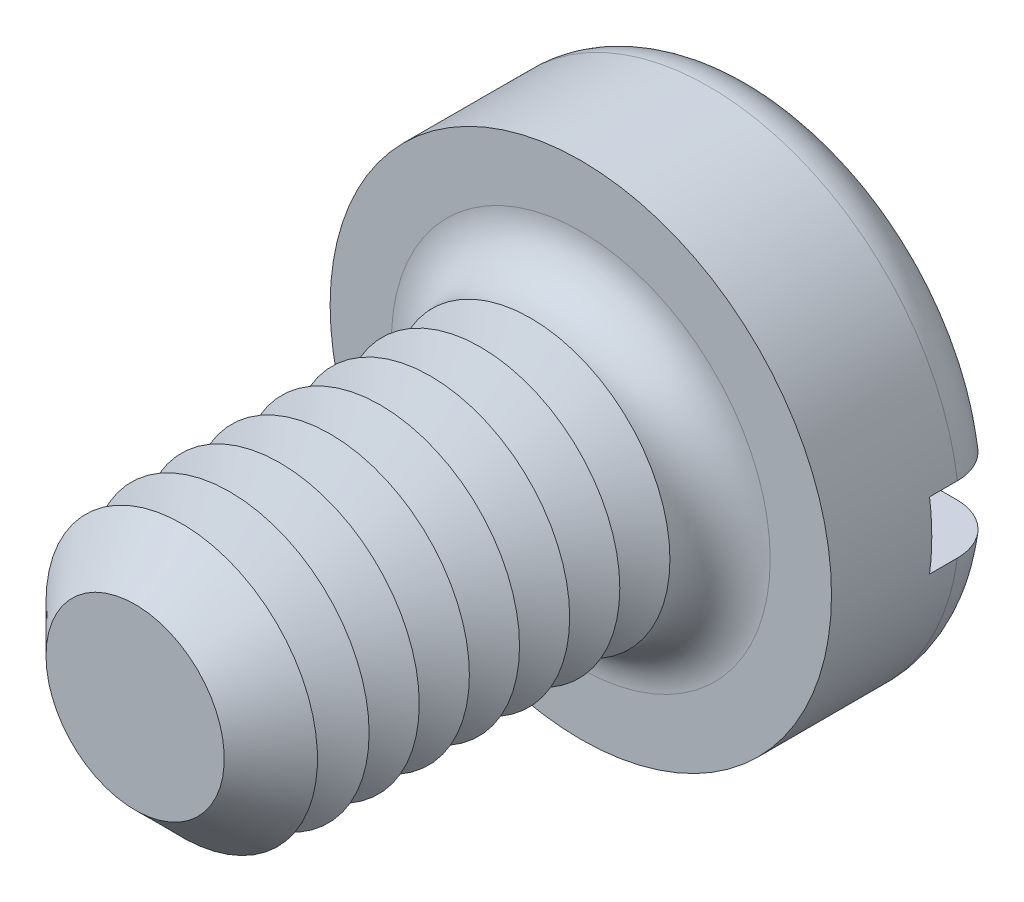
ISO-10303-21;
HEADER;
FILE_DESCRIPTION(('STEP AP214'),'2;1');
FILE_NAME('part.step','',(''),(''),'','','');
FILE_SCHEMA(('AUTOMOTIVE_DESIGN { 1 0 10303 214 1 1 1 1 }'));
ENDSEC;
DATA;
#1=APPLICATION_CONTEXT('core data for automotive mechanical design processes');
#2=APPLICATION_PROTOCOL_DEFINITION('international standard','automotive_design',2000,#1);
#3=PRODUCT_CONTEXT('',#1,'mechanical');
#4=PRODUCT('Part','Part','',(#3));
#5=PRODUCT_RELATED_PRODUCT_CATEGORY('part','',(#4));
#6=PRODUCT_DEFINITION_FORMATION('','',#4);
#7=PRODUCT_DEFINITION_CONTEXT('part definition',#1,'design');
#8=PRODUCT_DEFINITION('design','',#6,#7);
#9=PRODUCT_DEFINITION_SHAPE('','',#8);
#10=(LENGTH_UNIT() NAMED_UNIT(*) SI_UNIT(.MILLI.,.METRE.));
#11=(NAMED_UNIT(*) PLANE_ANGLE_UNIT() SI_UNIT($,.RADIAN.));
#12=(NAMED_UNIT(*) SI_UNIT($,.STERADIAN.) SOLID_ANGLE_UNIT());
#13=UNCERTAINTY_MEASURE_WITH_UNIT(LENGTH_MEASURE(1.E-05),#10,'distance_accuracy_value','');
#14=(GEOMETRIC_REPRESENTATION_CONTEXT(3) GLOBAL_UNCERTAINTY_ASSIGNED_CONTEXT((#13)) GLOBAL_UNIT_ASSIGNED_CONTEXT((#10,
#11,#12)) REPRESENTATION_CONTEXT('',''));
#15=CARTESIAN_POINT('',(0.,0.,0.));
#16=DIRECTION('',(0.,0.,1.));
#17=DIRECTION('',(1.,0.,0.));
#18=AXIS2_PLACEMENT_3D('',#15,#16,#17);
#19=CARTESIAN_POINT('',(0.,0.,-1.6));
#20=DIRECTION('',(0.,0.,1.));
#21=DIRECTION('',(1.,0.,0.));
#22=AXIS2_PLACEMENT_3D('',#19,#20,#21);
#23=PLANE('',#22);
#24=CARTESIAN_POINT('',(0.,0.,-1.6));
#25=DIRECTION('',(0.,0.,1.));
#26=DIRECTION('',(1.,0.,0.));
#27=AXIS2_PLACEMENT_3D('',#24,#25,#26);
#28=CIRCLE('',#27,1.8);
#29=CARTESIAN_POINT('',(-1.77482393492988,0.3,-1.6));
#30=VERTEX_POINT('',#29);
#31=CARTESIAN_POINT('',(1.77482393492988,0.3,-1.6));
#32=VERTEX_POINT('',#31);
#33=EDGE_CURVE('E116',#30,#32,#28,.F.);
#34=ORIENTED_EDGE('',*,*,#33,.T.);
#35=DIRECTION('',(1.,0.,0.));
#36=VECTOR('',#35,1.);
#37=CARTESIAN_POINT('',(-2.25,0.3,-1.6));
#38=LINE('',#37,#36);
#39=EDGE_CURVE('E111',#30,#32,#38,.T.);
#40=ORIENTED_EDGE('',*,*,#39,.F.);
#41=EDGE_LOOP('',(#34,#40));
#42=FACE_BOUND('',#41,.T.);
#43=ADVANCED_FACE('F39',(#42),#23,.F.);
#44=CARTESIAN_POINT('',(0.,0.,-1.15));
#45=DIRECTION('',(0.,0.,1.));
#46=DIRECTION('',(1.,0.,0.));
#47=AXIS2_PLACEMENT_3D('',#44,#45,#46);
#48=TOROIDAL_SURFACE('',#47,1.8,0.45);
#49=CARTESIAN_POINT('',(-2.09367249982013,0.3,-1.4713087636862));
#50=CARTESIAN_POINT('',(-2.07531034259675,0.3,-1.48912990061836));
#51=CARTESIAN_POINT('',(-2.05541605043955,0.3,-1.50540110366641));
#52=CARTESIAN_POINT('',(-2.01315405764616,0.3,-1.53437465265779));
#53=CARTESIAN_POINT('',(-1.99078310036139,0.3,-1.54707221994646));
#54=CARTESIAN_POINT('',(-1.94425163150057,0.3,-1.56853090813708));
#55=CARTESIAN_POINT('',(-1.92009286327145,0.3,-1.57729580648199));
#56=CARTESIAN_POINT('',(-1.8706617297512,0.3,-1.59068015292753));
#57=CARTESIAN_POINT('',(-1.84538964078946,0.3,-1.59530062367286));
#58=CARTESIAN_POINT('',(-1.7942134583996,0.3,-1.60031507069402));
#59=CARTESIAN_POINT('',(-1.76830582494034,0.3,-1.60067291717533));
#60=CARTESIAN_POINT('',(-1.71679040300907,0.3,-1.59707477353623));
#61=CARTESIAN_POINT('',(-1.69118264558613,0.3,-1.59311834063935));
#62=CARTESIAN_POINT('',(-1.64075792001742,0.3,-1.58095464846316));
#63=CARTESIAN_POINT('',(-1.61594989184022,0.3,-1.57271029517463));
#64=CARTESIAN_POINT('',(-1.56806655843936,0.3,-1.55217762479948));
#65=CARTESIAN_POINT('',(-1.54499130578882,0.3,-1.53988918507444));
#66=CARTESIAN_POINT('',(-1.50122413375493,0.3,-1.51158963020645));
#67=CARTESIAN_POINT('',(-1.48053389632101,0.3,-1.49557591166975));
#68=CARTESIAN_POINT('',(-1.44217532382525,0.3,-1.46026359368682));
#69=CARTESIAN_POINT('',(-1.42450683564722,0.3,-1.4409651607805));
#70=CARTESIAN_POINT('',(-1.39293961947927,0.3,-1.39986821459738));
#71=CARTESIAN_POINT('',(-1.37899788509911,0.3,-1.37810275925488));
#72=CARTESIAN_POINT('',(-1.35506190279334,0.3,-1.33249939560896));
#73=CARTESIAN_POINT('',(-1.34506709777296,0.3,-1.30866178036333));
#74=CARTESIAN_POINT('',(-1.3295415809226,0.3,-1.26015137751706));
#75=CARTESIAN_POINT('',(-1.32391771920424,0.3,-1.23550839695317));
#76=CARTESIAN_POINT('',(-1.31696995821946,0.3,-1.18562442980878));
#77=CARTESIAN_POINT('',(-1.31564552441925,0.3,-1.16038351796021));
#78=CARTESIAN_POINT('',(-1.31732714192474,0.3,-1.11049178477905));
#79=CARTESIAN_POINT('',(-1.32025766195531,0.3,-1.08583837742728));
#80=CARTESIAN_POINT('',(-1.3302124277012,0.3,-1.03737369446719));
#81=CARTESIAN_POINT('',(-1.33723664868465,0.3,-1.01356241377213));
#82=CARTESIAN_POINT('',(-1.35515820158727,0.3,-0.967413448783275));
#83=CARTESIAN_POINT('',(-1.36606032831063,0.3,-0.945077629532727));
#84=CARTESIAN_POINT('',(-1.39139351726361,0.3,-0.902507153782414));
#85=CARTESIAN_POINT('',(-1.40582489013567,0.3,-0.882272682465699));
#86=CARTESIAN_POINT('',(-1.43808691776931,0.3,-0.844072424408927));
#87=CARTESIAN_POINT('',(-1.4559757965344,0.3,-0.826155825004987));
#88=CARTESIAN_POINT('',(-1.49445205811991,0.3,-0.793502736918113));
#89=CARTESIAN_POINT('',(-1.51503974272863,0.3,-0.778766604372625));
#90=CARTESIAN_POINT('',(-1.55880475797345,0.3,-0.752571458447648));
#91=CARTESIAN_POINT('',(-1.58202794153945,0.3,-0.741189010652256));
#92=CARTESIAN_POINT('',(-1.63004083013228,0.3,-0.722432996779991));
#93=CARTESIAN_POINT('',(-1.65483064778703,0.3,-0.715059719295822));
#94=CARTESIAN_POINT('',(-1.70558060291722,0.3,-0.704463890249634));
#95=CARTESIAN_POINT('',(-1.73155090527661,0.3,-0.701289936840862));
#96=CARTESIAN_POINT('',(-1.78365633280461,0.3,-0.699350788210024));
#97=CARTESIAN_POINT('',(-1.80979145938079,0.3,-0.700585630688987));
#98=CARTESIAN_POINT('',(-1.86145503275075,0.3,-0.70744393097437));
#99=CARTESIAN_POINT('',(-1.88698403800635,0.3,-0.713063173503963));
#100=CARTESIAN_POINT('',(-1.93672112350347,0.3,-0.728546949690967));
#101=CARTESIAN_POINT('',(-1.96092925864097,0.3,-0.738411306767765));
#102=CARTESIAN_POINT('',(-2.00710191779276,0.3,-0.762015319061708));
#103=CARTESIAN_POINT('',(-2.02908465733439,0.3,-0.775719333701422));
#104=CARTESIAN_POINT('',(-2.0704025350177,0.3,-0.806663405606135));
#105=CARTESIAN_POINT('',(-2.08973782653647,0.3,-0.823903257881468));
#106=CARTESIAN_POINT('',(-2.12497879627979,0.3,-0.861218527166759));
#107=CARTESIAN_POINT('',(-2.1409209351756,0.3,-0.881259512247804));
#108=CARTESIAN_POINT('',(-2.16917502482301,0.3,-0.92375535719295));
#109=CARTESIAN_POINT('',(-2.18148717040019,0.3,-0.946210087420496));
#110=CARTESIAN_POINT('',(-2.20201023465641,0.3,-0.99266079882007));
#111=CARTESIAN_POINT('',(-2.21025973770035,0.3,-1.01663973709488));
#112=CARTESIAN_POINT('',(-2.22258852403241,0.3,-1.06564563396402));
#113=CARTESIAN_POINT('',(-2.22666813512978,0.3,-1.0906725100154));
#114=CARTESIAN_POINT('',(-2.23052418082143,0.3,-1.14090288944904));
#115=CARTESIAN_POINT('',(-2.23032644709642,0.3,-1.16610441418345));
#116=CARTESIAN_POINT('',(-2.22569614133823,0.3,-1.21612212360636));
#117=CARTESIAN_POINT('',(-2.2212625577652,0.3,-1.24093821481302));
#118=CARTESIAN_POINT('',(-2.20829785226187,0.3,-1.2894516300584));
#119=CARTESIAN_POINT('',(-2.19976997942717,0.3,-1.31314982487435));
#120=CARTESIAN_POINT('',(-2.17887390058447,0.3,-1.35876313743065));
#121=CARTESIAN_POINT('',(-2.1665103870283,0.3,-1.3806803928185));
#122=CARTESIAN_POINT('',(-2.14384463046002,0.3,-1.4140108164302));
#123=CARTESIAN_POINT('',(-2.13462949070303,0.3,-1.42617780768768));
#124=CARTESIAN_POINT('',(-2.1150151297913,0.3,-1.44951629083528));
#125=CARTESIAN_POINT('',(-2.10461591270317,0.3,-1.46068778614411));
#126=CARTESIAN_POINT('',(-2.09367249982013,0.3,-1.4713087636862));
#127=B_SPLINE_CURVE_WITH_KNOTS('',3,(#49,#50,#51,#52,#53,#54,#55,#56,#57,#58,#59,#60,#61,#62,
#63,#64,#65,#66,#67,#68,#69,#70,#71,#72,#73,#74,#75,#76,#77,#78,#79,#80,#81,#82,#83,#84,#85,#86,
#87,#88,#89,#90,#91,#92,#93,#94,#95,#96,#97,#98,#99,#100,#101,#102,#103,#104,#105,#106,#107,
#108,#109,#110,#111,#112,#113,#114,#115,#116,#117,#118,#119,#120,#121,#122,#123,#124,#125,#126),
.UNSPECIFIED.,.T.,.F.,(4,2,2,2,2,2,2,2,2,2,2,2,2,2,2,2,2,2,2,2,2,2,2,2,2,2,2,2,2,2,2,2,2,2,2,2,
2,2,4),(0.,0.0767085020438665,0.153519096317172,0.230255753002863,0.306973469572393,
0.384340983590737,0.461716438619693,0.539772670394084,0.617831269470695,0.695944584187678,
0.774053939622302,0.851218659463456,0.928372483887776,1.00383319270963,1.07928451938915,
1.15341274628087,1.22754052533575,1.30176027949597,1.37598656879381,1.45159320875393,
1.52720831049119,1.6044355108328,1.68166826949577,1.75978723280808,1.8379068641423,
1.91595148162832,1.99399285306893,2.07133254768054,2.14866775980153,2.22512456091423,
2.30157725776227,2.3772891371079,2.45299506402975,2.52824391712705,2.60351074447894,
2.67871794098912,2.75383349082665,2.79955010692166,2.84526656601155),.UNSPECIFIED.);
#128=CARTESIAN_POINT('',(-2.22991031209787,0.3,-1.14999999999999));
#129=VERTEX_POINT('',#128);
#130=EDGE_CURVE('E240',#129,#30,#127,.T.);
#131=ORIENTED_EDGE('',*,*,#130,.F.);
#132=CARTESIAN_POINT('',(0.,0.,-1.15));
#133=DIRECTION('',(0.,0.,1.));
#134=DIRECTION('',(1.,0.,0.));
#135=AXIS2_PLACEMENT_3D('',#132,#133,#134);
#136=CIRCLE('',#135,2.25);
#137=CARTESIAN_POINT('',(2.22991031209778,0.3,-1.15));
#138=VERTEX_POINT('',#137);
#139=EDGE_CURVE('E124',#138,#129,#136,.T.);
#140=ORIENTED_EDGE('',*,*,#139,.F.);
#141=CARTESIAN_POINT('',(1.39325818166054,0.3,-1.39903402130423));
#142=CARTESIAN_POINT('',(1.40771723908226,0.3,-1.42030595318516));
#143=CARTESIAN_POINT('',(1.4240122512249,0.3,-1.4403555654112));
#144=CARTESIAN_POINT('',(1.45976320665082,0.3,-1.4774406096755));
#145=CARTESIAN_POINT('',(1.47922380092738,0.3,-1.49447152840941));
#146=CARTESIAN_POINT('',(1.5206923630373,0.3,-1.52502510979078));
#147=CARTESIAN_POINT('',(1.54269721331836,0.3,-1.53855200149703));
#148=CARTESIAN_POINT('',(1.58863815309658,0.3,-1.56176272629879));
#149=CARTESIAN_POINT('',(1.61257369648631,0.3,-1.57144764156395));
#150=CARTESIAN_POINT('',(1.66199169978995,0.3,-1.58680804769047));
#151=CARTESIAN_POINT('',(1.68748839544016,0.3,-1.59243778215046));
#152=CARTESIAN_POINT('',(1.73906656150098,0.3,-1.59934902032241));
#153=CARTESIAN_POINT('',(1.76514807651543,0.3,-1.60063019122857));
#154=CARTESIAN_POINT('',(1.81721740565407,0.3,-1.59879130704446));
#155=CARTESIAN_POINT('',(1.84320486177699,0.3,-1.59566102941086));
#156=CARTESIAN_POINT('',(1.89427635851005,0.3,-1.58504931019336));
#157=CARTESIAN_POINT('',(1.91936042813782,0.3,-1.57756800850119));
#158=CARTESIAN_POINT('',(1.9677137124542,0.3,-1.55851722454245));
#159=CARTESIAN_POINT('',(1.99099484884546,0.3,-1.5469780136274));
#160=CARTESIAN_POINT('',(2.03525897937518,0.3,-1.52011224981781));
#161=CARTESIAN_POINT('',(2.05624211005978,0.3,-1.50478592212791));
#162=CARTESIAN_POINT('',(2.09506403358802,0.3,-1.47096472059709));
#163=CARTESIAN_POINT('',(2.11293536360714,0.3,-1.45250719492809));
#164=CARTESIAN_POINT('',(2.14528563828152,0.3,-1.41282609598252));
#165=CARTESIAN_POINT('',(2.15976477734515,0.3,-1.39160268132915));
#166=CARTESIAN_POINT('',(2.18476262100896,0.3,-1.34723254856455));
#167=CARTESIAN_POINT('',(2.19532119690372,0.3,-1.32410828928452));
#168=CARTESIAN_POINT('',(2.21237438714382,0.3,-1.27640693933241));
#169=CARTESIAN_POINT('',(2.21886918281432,0.3,-1.25182991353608));
#170=CARTESIAN_POINT('',(2.2275687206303,0.3,-1.20210937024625));
#171=CARTESIAN_POINT('',(2.22980376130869,0.3,-1.17697115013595));
#172=CARTESIAN_POINT('',(2.23000940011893,0.3,-1.12667754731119));
#173=CARTESIAN_POINT('',(2.22798009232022,0.3,-1.10152216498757));
#174=CARTESIAN_POINT('',(2.21972856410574,0.3,-1.05197773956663));
#175=CARTESIAN_POINT('',(2.21351744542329,0.3,-1.02758684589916));
#176=CARTESIAN_POINT('',(2.19709696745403,0.3,-0.980190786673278));
#177=CARTESIAN_POINT('',(2.18688760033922,0.3,-0.957185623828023));
#178=CARTESIAN_POINT('',(2.1627435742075,0.3,-0.913157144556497));
#179=CARTESIAN_POINT('',(2.14880093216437,0.3,-0.892138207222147));
#180=CARTESIAN_POINT('',(2.11760640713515,0.3,-0.852719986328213));
#181=CARTESIAN_POINT('',(2.10035443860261,0.3,-0.834320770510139));
#182=CARTESIAN_POINT('',(2.06291254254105,0.3,-0.80052923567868));
#183=CARTESIAN_POINT('',(2.04270386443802,0.3,-0.785157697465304));
#184=CARTESIAN_POINT('',(2.0000139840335,0.3,-0.757986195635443));
#185=CARTESIAN_POINT('',(1.97753267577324,0.3,-0.746186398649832));
#186=CARTESIAN_POINT('',(1.93069507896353,0.3,-0.726364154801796));
#187=CARTESIAN_POINT('',(1.90632219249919,0.3,-0.718380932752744));
#188=CARTESIAN_POINT('',(1.85658993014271,0.3,-0.706569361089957));
#189=CARTESIAN_POINT('',(1.83123049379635,0.3,-0.702741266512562));
#190=CARTESIAN_POINT('',(1.77994107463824,0.3,-0.699306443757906));
#191=CARTESIAN_POINT('',(1.75400788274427,0.3,-0.69974759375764));
#192=CARTESIAN_POINT('',(1.70257608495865,0.3,-0.704939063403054));
#193=CARTESIAN_POINT('',(1.67707750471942,0.3,-0.709689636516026));
#194=CARTESIAN_POINT('',(1.62701662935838,0.3,-0.723419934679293));
#195=CARTESIAN_POINT('',(1.60246387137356,0.3,-0.732434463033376));
#196=CARTESIAN_POINT('',(1.55521886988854,0.3,-0.754458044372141));
#197=CARTESIAN_POINT('',(1.53252668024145,0.3,-0.76746721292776));
#198=CARTESIAN_POINT('',(1.48966925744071,0.3,-0.797124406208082));
#199=CARTESIAN_POINT('',(1.46950315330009,0.3,-0.813771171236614));
#200=CARTESIAN_POINT('',(1.43229728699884,0.3,-0.850255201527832));
#201=CARTESIAN_POINT('',(1.41525734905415,0.3,-0.870092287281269));
#202=CARTESIAN_POINT('',(1.3850470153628,0.3,-0.912123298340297));
#203=CARTESIAN_POINT('',(1.37182821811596,0.3,-0.934282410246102));
#204=CARTESIAN_POINT('',(1.34939737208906,0.3,-0.980542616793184));
#205=CARTESIAN_POINT('',(1.34018456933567,0.3,-1.00464334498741));
#206=CARTESIAN_POINT('',(1.32624172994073,0.3,-1.05352472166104));
#207=CARTESIAN_POINT('',(1.32141599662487,0.3,-1.07827808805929));
#208=CARTESIAN_POINT('',(1.31606478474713,0.3,-1.12825155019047));
#209=CARTESIAN_POINT('',(1.31553992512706,0.3,-1.15347171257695));
#210=CARTESIAN_POINT('',(1.31878307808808,0.3,-1.20323022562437));
#211=CARTESIAN_POINT('',(1.32248353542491,0.3,-1.22777305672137));
#212=CARTESIAN_POINT('',(1.33394086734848,0.3,-1.27586981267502));
#213=CARTESIAN_POINT('',(1.34169274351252,0.3,-1.2994249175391));
#214=CARTESIAN_POINT('',(1.35704250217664,0.3,-1.33561898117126));
#215=CARTESIAN_POINT('',(1.36341395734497,0.3,-1.34879219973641));
#216=CARTESIAN_POINT('',(1.37741190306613,0.3,-1.37445328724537));
#217=CARTESIAN_POINT('',(1.38503837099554,0.3,-1.38694116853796));
#218=CARTESIAN_POINT('',(1.39325818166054,0.3,-1.39903402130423));
#219=B_SPLINE_CURVE_WITH_KNOTS('',3,(#141,#142,#143,#144,#145,#146,#147,#148,#149,#150,#151,
#152,#153,#154,#155,#156,#157,#158,#159,#160,#161,#162,#163,#164,#165,#166,#167,#168,#169,#170,
#171,#172,#173,#174,#175,#176,#177,#178,#179,#180,#181,#182,#183,#184,#185,#186,#187,#188,#189,
#190,#191,#192,#193,#194,#195,#196,#197,#198,#199,#200,#201,#202,#203,#204,#205,#206,#207,#208,
#209,#210,#211,#212,#213,#214,#215,#216,#217,#218),.UNSPECIFIED.,.T.,.F.,(4,2,2,2,2,2,2,2,2,2,2,
2,2,2,2,2,2,2,2,2,2,2,2,2,2,2,2,2,2,2,2,2,2,2,2,2,2,2,4),(0.,0.0771077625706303,
0.154329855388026,0.231458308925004,0.308565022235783,0.386528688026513,0.464498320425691,
0.542648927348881,0.620797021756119,0.698374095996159,0.77594655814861,0.852651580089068,
0.929352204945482,1.00524992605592,1.08114426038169,1.15649673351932,1.2318475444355,
1.30699910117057,1.38215080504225,1.45746451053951,1.53278016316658,1.60859599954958,
1.68441537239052,1.76099806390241,1.83758545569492,1.91503273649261,1.99248457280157,
2.07057979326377,2.14867727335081,2.22674775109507,2.30481383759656,2.38184276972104,
2.45885719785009,2.53414829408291,2.6094502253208,2.68356487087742,2.75758829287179,
2.80142397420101,2.84525886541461),.UNSPECIFIED.);
#220=EDGE_CURVE('E242',#32,#138,#219,.T.);
#221=ORIENTED_EDGE('',*,*,#220,.F.);
#222=ORIENTED_EDGE('',*,*,#33,.F.);
#223=EDGE_LOOP('',(#131,#140,#221,#222));
#224=FACE_BOUND('',#223,.T.);
#225=ADVANCED_FACE('F224',(#224),#48,.T.);
#226=CARTESIAN_POINT('',(0.,0.,-1.6));
#227=DIRECTION('',(0.,0.,1.));
#228=DIRECTION('',(1.,0.,0.));
#229=AXIS2_PLACEMENT_3D('',#226,#227,#228);
#230=CYLINDRICAL_SURFACE('',#229,2.25);
#231=DIRECTION('',(0.,0.,1.));
#232=VECTOR('',#231,1.);
#233=CARTESIAN_POINT('',(2.22991031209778,0.3,-1.6));
#234=LINE('',#233,#232);
#235=CARTESIAN_POINT('',(2.22991031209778,0.3,-0.9));
#236=VERTEX_POINT('',#235);
#237=EDGE_CURVE('E256',#138,#236,#234,.T.);
#238=ORIENTED_EDGE('',*,*,#237,.F.);
#239=ORIENTED_EDGE('',*,*,#139,.T.);
#240=DIRECTION('',(0.,0.,1.));
#241=VECTOR('',#240,1.);
#242=CARTESIAN_POINT('',(-2.22991031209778,0.3,-1.6));
#243=LINE('',#242,#241);
#244=CARTESIAN_POINT('',(-2.22991031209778,0.3,-0.9));
#245=VERTEX_POINT('',#244);
#246=EDGE_CURVE('E63',#245,#129,#243,.F.);
#247=ORIENTED_EDGE('',*,*,#246,.F.);
#248=CARTESIAN_POINT('',(0.,0.,-0.9));
#249=DIRECTION('',(0.,0.,-1.));
#250=DIRECTION('',(-1.,0.,0.));
#251=AXIS2_PLACEMENT_3D('',#248,#249,#250);
#252=CIRCLE('',#251,2.25);
#253=CARTESIAN_POINT('',(-2.22991031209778,-0.3,-0.9));
#254=VERTEX_POINT('',#253);
#255=EDGE_CURVE('E43',#245,#254,#252,.F.);
#256=ORIENTED_EDGE('',*,*,#255,.T.);
#257=DIRECTION('',(0.,0.,1.));
#258=VECTOR('',#257,1.);
#259=CARTESIAN_POINT('',(-2.22991031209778,-0.3,-1.6));
#260=LINE('',#259,#258);
#261=CARTESIAN_POINT('',(-2.22991031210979,-0.3,-1.15000000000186));
#262=VERTEX_POINT('',#261);
#263=EDGE_CURVE('E254',#262,#254,#260,.T.);
#264=ORIENTED_EDGE('',*,*,#263,.F.);
#265=CARTESIAN_POINT('',(2.22991031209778,-0.3,-1.15));
#266=VERTEX_POINT('',#265);
#267=EDGE_CURVE('E126',#262,#266,#136,.T.);
#268=ORIENTED_EDGE('',*,*,#267,.T.);
#269=DIRECTION('',(0.,0.,1.));
#270=VECTOR('',#269,1.);
#271=CARTESIAN_POINT('',(2.22991031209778,-0.3,-1.6));
#272=LINE('',#271,#270);
#273=CARTESIAN_POINT('',(2.22991031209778,-0.3,-0.9));
#274=VERTEX_POINT('',#273);
#275=EDGE_CURVE('E55',#274,#266,#272,.F.);
#276=ORIENTED_EDGE('',*,*,#275,.F.);
#277=EDGE_CURVE('E11',#274,#236,#252,.F.);
#278=ORIENTED_EDGE('',*,*,#277,.T.);
#279=EDGE_LOOP('',(#238,#239,#247,#256,#264,#268,#276,#278));
#280=FACE_BOUND('',#279,.T.);
#281=CARTESIAN_POINT('',(0.,0.,0.));
#282=DIRECTION('',(0.,0.,1.));
#283=DIRECTION('',(1.,0.,0.));
#284=AXIS2_PLACEMENT_3D('',#281,#282,#283);
#285=CIRCLE('',#284,2.25);
#286=CARTESIAN_POINT('',(2.25,0.,0.));
#287=VERTEX_POINT('',#286);
#288=EDGE_CURVE('E259',#287,#287,#285,.T.);
#289=ORIENTED_EDGE('',*,*,#288,.F.);
#290=EDGE_LOOP('',(#289));
#291=FACE_BOUND('',#290,.T.);
#292=ADVANCED_FACE('F220',(#280,#291),#230,.T.);
#293=CARTESIAN_POINT('',(1.77482393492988,-0.3,-1.6));
#294=VERTEX_POINT('',#293);
#295=CARTESIAN_POINT('',(-1.77482393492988,-0.3,-1.6));
#296=VERTEX_POINT('',#295);
#297=EDGE_CURVE('E109',#294,#296,#28,.F.);
#298=ORIENTED_EDGE('',*,*,#297,.T.);
#299=DIRECTION('',(-1.,0.,0.));
#300=VECTOR('',#299,1.);
#301=CARTESIAN_POINT('',(-2.25,-0.3,-1.6));
#302=LINE('',#301,#300);
#303=EDGE_CURVE('E96',#294,#296,#302,.T.);
#304=ORIENTED_EDGE('',*,*,#303,.F.);
#305=EDGE_LOOP('',(#298,#304));
#306=FACE_BOUND('',#305,.T.);
#307=ADVANCED_FACE('F108',(#306),#23,.F.);
#308=CARTESIAN_POINT('',(0.,0.,0.));
#309=DIRECTION('',(0.,0.,1.));
#310=DIRECTION('',(1.,0.,0.));
#311=AXIS2_PLACEMENT_3D('',#308,#309,#310);
#312=PLANE('',#311);
#313=CARTESIAN_POINT('',(0.,0.,0.));
#314=DIRECTION('',(0.,0.,1.));
#315=DIRECTION('',(1.,0.,0.));
#316=AXIS2_PLACEMENT_3D('',#313,#314,#315);
#317=CIRCLE('',#316,1.7);
#318=CARTESIAN_POINT('',(1.7,0.,0.));
#319=VERTEX_POINT('',#318);
#320=EDGE_CURVE('E115',#319,#319,#317,.F.);
#321=ORIENTED_EDGE('',*,*,#320,.T.);
#322=EDGE_LOOP('',(#321));
#323=FACE_BOUND('',#322,.T.);
#324=ORIENTED_EDGE('',*,*,#288,.T.);
#325=EDGE_LOOP('',(#324));
#326=FACE_BOUND('',#325,.T.);
#327=ADVANCED_FACE('F219',(#323,#326),#312,.T.);
#328=CARTESIAN_POINT('',(-2.09367249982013,-0.3,-1.4713087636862));
#329=CARTESIAN_POINT('',(-2.11176539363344,-0.3,-1.45374579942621));
#330=CARTESIAN_POINT('',(-2.1283968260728,-0.3,-1.43465254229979));
#331=CARTESIAN_POINT('',(-2.15823692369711,-0.3,-1.39393307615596));
#332=CARTESIAN_POINT('',(-2.17144184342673,-0.3,-1.37230413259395));
#333=CARTESIAN_POINT('',(-2.19402281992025,-0.3,-1.32713362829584));
#334=CARTESIAN_POINT('',(-2.20339951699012,-0.3,-1.30359238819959));
#335=CARTESIAN_POINT('',(-2.21804409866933,-0.3,-1.25527081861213));
#336=CARTESIAN_POINT('',(-2.22331295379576,-0.3,-1.23049078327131));
#337=CARTESIAN_POINT('',(-2.22957448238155,-0.3,-1.18050893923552));
#338=CARTESIAN_POINT('',(-2.23058617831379,-0.3,-1.15530951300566));
#339=CARTESIAN_POINT('',(-2.22835535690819,-0.3,-1.10509920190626));
#340=CARTESIAN_POINT('',(-2.22511277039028,-0.3,-1.08008832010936));
#341=CARTESIAN_POINT('',(-2.21448018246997,-0.3,-1.03101646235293));
#342=CARTESIAN_POINT('',(-2.20709836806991,-0.3,-1.00695371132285));
#343=CARTESIAN_POINT('',(-2.18841075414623,-0.3,-0.960404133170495));
#344=CARTESIAN_POINT('',(-2.17710493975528,-0.3,-0.937917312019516));
#345=CARTESIAN_POINT('',(-2.15086234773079,-0.3,-0.895085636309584));
#346=CARTESIAN_POINT('',(-2.13591537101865,-0.3,-0.874747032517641));
#347=CARTESIAN_POINT('',(-2.1028415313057,-0.3,-0.836845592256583));
#348=CARTESIAN_POINT('',(-2.08471458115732,-0.3,-0.819282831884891));
#349=CARTESIAN_POINT('',(-2.0456590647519,-0.3,-0.78729174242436));
#350=CARTESIAN_POINT('',(-2.0247112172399,-0.3,-0.772886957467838));
#351=CARTESIAN_POINT('',(-1.98071452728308,-0.3,-0.747756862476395));
#352=CARTESIAN_POINT('',(-1.95766557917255,-0.3,-0.737031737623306));
#353=CARTESIAN_POINT('',(-1.90986554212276,-0.3,-0.71944451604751));
#354=CARTESIAN_POINT('',(-1.88509923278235,-0.3,-0.712623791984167));
#355=CARTESIAN_POINT('',(-1.83477837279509,-0.3,-0.703186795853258));
#356=CARTESIAN_POINT('',(-1.80922377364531,-0.3,-0.700570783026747));
#357=CARTESIAN_POINT('',(-1.75774893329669,-0.3,-0.699591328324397));
#358=CARTESIAN_POINT('',(-1.73182778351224,-0.3,-0.701275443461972));
#359=CARTESIAN_POINT('',(-1.68062744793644,-0.3,-0.708937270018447));
#360=CARTESIAN_POINT('',(-1.65534829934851,-0.3,-0.714915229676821));
#361=CARTESIAN_POINT('',(-1.6059539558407,-0.3,-0.731056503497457));
#362=CARTESIAN_POINT('',(-1.58184881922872,-0.3,-0.741250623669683));
#363=CARTESIAN_POINT('',(-1.53569497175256,-0.3,-0.765548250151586));
#364=CARTESIAN_POINT('',(-1.51364629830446,-0.3,-0.779651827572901));
#365=CARTESIAN_POINT('',(-1.47229470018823,-0.3,-0.811355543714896));
#366=CARTESIAN_POINT('',(-1.45298625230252,-0.3,-0.828948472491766));
#367=CARTESIAN_POINT('',(-1.41765142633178,-0.3,-0.867170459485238));
#368=CARTESIAN_POINT('',(-1.40162480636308,-0.3,-0.887799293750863));
#369=CARTESIAN_POINT('',(-1.37358365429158,-0.3,-0.93118317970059));
#370=CARTESIAN_POINT('',(-1.3615121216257,-0.3,-0.953901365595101));
#371=CARTESIAN_POINT('',(-1.34145576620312,-0.3,-1.00107529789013));
#372=CARTESIAN_POINT('',(-1.33347032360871,-0.3,-1.02553078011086));
#373=CARTESIAN_POINT('',(-1.32199536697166,-0.3,-1.07489401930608));
#374=CARTESIAN_POINT('',(-1.31840873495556,-0.3,-1.09977921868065));
#375=CARTESIAN_POINT('',(-1.31553052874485,-0.3,-1.1497957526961));
#376=CARTESIAN_POINT('',(-1.31623852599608,-0.3,-1.17492706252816));
#377=CARTESIAN_POINT('',(-1.32188368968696,-0.3,-1.22435119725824));
#378=CARTESIAN_POINT('',(-1.32676151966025,-0.3,-1.24865083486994));
#379=CARTESIAN_POINT('',(-1.34050334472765,-0.3,-1.29609421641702));
#380=CARTESIAN_POINT('',(-1.34936742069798,-0.3,-1.31923793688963));
#381=CARTESIAN_POINT('',(-1.37086295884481,-0.3,-1.36387796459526));
#382=CARTESIAN_POINT('',(-1.38351729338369,-0.3,-1.38536324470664));
#383=CARTESIAN_POINT('',(-1.41218367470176,-0.3,-1.42596199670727));
#384=CARTESIAN_POINT('',(-1.42819606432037,-0.3,-1.44507522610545));
#385=CARTESIAN_POINT('',(-1.46347664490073,-0.3,-1.48081087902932));
#386=CARTESIAN_POINT('',(-1.48280543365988,-0.3,-1.49737347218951));
#387=CARTESIAN_POINT('',(-1.5239232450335,-0.3,-1.52709508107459));
#388=CARTESIAN_POINT('',(-1.54571253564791,-0.3,-1.54025372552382));
#389=CARTESIAN_POINT('',(-1.59160097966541,-0.3,-1.56305446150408));
#390=CARTESIAN_POINT('',(-1.61573734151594,-0.3,-1.57262172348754));
#391=CARTESIAN_POINT('',(-1.66526504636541,-0.3,-1.58760700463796));
#392=CARTESIAN_POINT('',(-1.69065641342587,-0.3,-1.59302494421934));
#393=CARTESIAN_POINT('',(-1.74220154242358,-0.3,-1.59958446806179));
#394=CARTESIAN_POINT('',(-1.7683598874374,-0.3,-1.60069012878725));
#395=CARTESIAN_POINT('',(-1.82049681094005,-0.3,-1.59847888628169));
#396=CARTESIAN_POINT('',(-1.8464753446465,-0.3,-1.59516091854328));
#397=CARTESIAN_POINT('',(-1.89742078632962,-0.3,-1.58419269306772));
#398=CARTESIAN_POINT('',(-1.92239041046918,-0.3,-1.57655503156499));
#399=CARTESIAN_POINT('',(-1.97064988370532,-0.3,-1.55715679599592));
#400=CARTESIAN_POINT('',(-1.99394179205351,-0.3,-1.54540138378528));
#401=CARTESIAN_POINT('',(-2.03003215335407,-0.3,-1.52312594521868));
#402=CARTESIAN_POINT('',(-2.04354254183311,-0.3,-1.51373809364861));
#403=CARTESIAN_POINT('',(-2.06946640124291,-0.3,-1.49355310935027));
#404=CARTESIAN_POINT('',(-2.08187987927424,-0.3,-1.48275598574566));
#405=CARTESIAN_POINT('',(-2.09367249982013,-0.3,-1.4713087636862));
#406=B_SPLINE_CURVE_WITH_KNOTS('',3,(#328,#329,#330,#331,#332,#333,#334,#335,#336,#337,#338,
#339,#340,#341,#342,#343,#344,#345,#346,#347,#348,#349,#350,#351,#352,#353,#354,#355,#356,#357,
#358,#359,#360,#361,#362,#363,#364,#365,#366,#367,#368,#369,#370,#371,#372,#373,#374,#375,#376,
#377,#378,#379,#380,#381,#382,#383,#384,#385,#386,#387,#388,#389,#390,#391,#392,#393,#394,#395,
#396,#397,#398,#399,#400,#401,#402,#403,#404,#405),.UNSPECIFIED.,.T.,.F.,(4,2,2,2,2,2,2,2,2,2,2,
2,2,2,2,2,2,2,2,2,2,2,2,2,2,2,2,2,2,2,2,2,2,2,2,2,2,2,4),(0.,0.0755864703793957,
0.151255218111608,0.226911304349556,0.302549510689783,0.377849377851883,0.453150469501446,
0.528303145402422,0.603456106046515,0.67882204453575,0.754190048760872,0.83010216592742,
0.906018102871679,0.982724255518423,1.05943513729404,1.13699806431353,1.21456547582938,
1.29270994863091,1.37085584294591,1.44884191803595,1.52682224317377,1.60362346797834,
1.68041303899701,1.75547480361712,1.83052907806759,1.90453278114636,1.97853798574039,
2.05299909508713,2.12746781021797,2.20347986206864,2.27950020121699,2.3570265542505,
2.43455439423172,2.5127267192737,2.59091785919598,2.66888216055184,2.74674907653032,
2.79601528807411,2.84528118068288),.UNSPECIFIED.);
#407=EDGE_CURVE('E103',#296,#262,#406,.T.);
#408=ORIENTED_EDGE('',*,*,#407,.F.);
#409=ORIENTED_EDGE('',*,*,#297,.F.);
#410=CARTESIAN_POINT('',(1.39325818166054,-0.3,-1.39903402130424));
#411=CARTESIAN_POINT('',(1.37924349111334,-0.3,-1.37841200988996));
#412=CARTESIAN_POINT('',(1.36693374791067,-0.3,-1.35661225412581));
#413=CARTESIAN_POINT('',(1.34612289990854,-0.3,-1.31124547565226));
#414=CARTESIAN_POINT('',(1.33762533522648,-0.3,-1.28767683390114));
#415=CARTESIAN_POINT('',(1.32472877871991,-0.3,-1.23943261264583));
#416=CARTESIAN_POINT('',(1.3203309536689,-0.3,-1.21475672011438));
#417=CARTESIAN_POINT('',(1.31579198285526,-0.3,-1.16502199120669));
#418=CARTESIAN_POINT('',(1.31564980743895,-0.3,-1.13996324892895));
#419=CARTESIAN_POINT('',(1.31960322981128,-0.3,-1.09044336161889));
#420=CARTESIAN_POINT('',(1.32365524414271,-0.3,-1.06597872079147));
#421=CARTESIAN_POINT('',(1.33579339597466,-0.3,-1.01807218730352));
#422=CARTESIAN_POINT('',(1.34387971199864,-0.3,-0.994630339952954));
#423=CARTESIAN_POINT('',(1.36386460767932,-0.3,-0.949319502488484));
#424=CARTESIAN_POINT('',(1.37577869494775,-0.3,-0.92745736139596));
#425=CARTESIAN_POINT('',(1.40303929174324,-0.3,-0.885990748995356));
#426=CARTESIAN_POINT('',(1.41838612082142,-0.3,-0.866386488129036));
#427=CARTESIAN_POINT('',(1.45239955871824,-0.3,-0.829572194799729));
#428=CARTESIAN_POINT('',(1.47112624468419,-0.3,-0.812417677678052));
#429=CARTESIAN_POINT('',(1.51114353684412,-0.3,-0.78141873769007));
#430=CARTESIAN_POINT('',(1.53243442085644,-0.3,-0.767574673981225));
#431=CARTESIAN_POINT('',(1.57744959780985,-0.3,-0.743302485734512));
#432=CARTESIAN_POINT('',(1.6012148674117,-0.3,-0.732950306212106));
#433=CARTESIAN_POINT('',(1.65013556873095,-0.3,-0.71633816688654));
#434=CARTESIAN_POINT('',(1.67529109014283,-0.3,-0.710078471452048));
#435=CARTESIAN_POINT('',(1.72654223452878,-0.3,-0.701786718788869));
#436=CARTESIAN_POINT('',(1.75264462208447,-0.3,-0.699796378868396));
#437=CARTESIAN_POINT('',(1.80481283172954,-0.3,-0.700236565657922));
#438=CARTESIAN_POINT('',(1.83087865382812,-0.3,-0.702667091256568));
#439=CARTESIAN_POINT('',(1.88216421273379,-0.3,-0.71188843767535));
#440=CARTESIAN_POINT('',(1.90738581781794,-0.3,-0.718668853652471));
#441=CARTESIAN_POINT('',(1.95631449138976,-0.3,-0.736408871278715));
#442=CARTESIAN_POINT('',(1.98002162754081,-0.3,-0.747368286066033));
#443=CARTESIAN_POINT('',(2.02500221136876,-0.3,-0.773046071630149));
#444=CARTESIAN_POINT('',(2.04629687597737,-0.3,-0.78772726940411));
#445=CARTESIAN_POINT('',(2.08608258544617,-0.3,-0.820494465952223));
#446=CARTESIAN_POINT('',(2.10457379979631,-0.3,-0.838580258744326));
#447=CARTESIAN_POINT('',(2.1380062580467,-0.3,-0.877422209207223));
#448=CARTESIAN_POINT('',(2.15298532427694,-0.3,-0.898145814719));
#449=CARTESIAN_POINT('',(2.17921311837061,-0.3,-0.941832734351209));
#450=CARTESIAN_POINT('',(2.19046204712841,-0.3,-0.964795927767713));
#451=CARTESIAN_POINT('',(2.20880507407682,-0.3,-1.01207981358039));
#452=CARTESIAN_POINT('',(2.2159367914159,-0.3,-1.0363859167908));
#453=CARTESIAN_POINT('',(2.22599386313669,-0.3,-1.08585317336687));
#454=CARTESIAN_POINT('',(2.22891936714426,-0.3,-1.11101429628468));
#455=CARTESIAN_POINT('',(2.23047255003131,-0.3,-1.16133395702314));
#456=CARTESIAN_POINT('',(2.22912306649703,-0.3,-1.18649179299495));
#457=CARTESIAN_POINT('',(2.22221641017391,-0.3,-1.236222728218));
#458=CARTESIAN_POINT('',(2.21665928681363,-0.3,-1.26079583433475));
#459=CARTESIAN_POINT('',(2.20150655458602,-0.3,-1.30864604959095));
#460=CARTESIAN_POINT('',(2.19191347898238,-0.3,-1.3319239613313));
#461=CARTESIAN_POINT('',(2.16897085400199,-0.3,-1.37654778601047));
#462=CARTESIAN_POINT('',(2.15562126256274,-0.3,-1.39789367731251));
#463=CARTESIAN_POINT('',(2.12549147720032,-0.3,-1.43814583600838));
#464=CARTESIAN_POINT('',(2.1086973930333,-0.3,-1.45704170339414));
#465=CARTESIAN_POINT('',(2.07219852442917,-0.3,-1.491773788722));
#466=CARTESIAN_POINT('',(2.0524936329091,-0.3,-1.50760989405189));
#467=CARTESIAN_POINT('',(2.01056127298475,-0.3,-1.53591667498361));
#468=CARTESIAN_POINT('',(1.98831430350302,-0.3,-1.54835845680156));
#469=CARTESIAN_POINT('',(1.94206418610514,-0.3,-1.5693763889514));
#470=CARTESIAN_POINT('',(1.91806093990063,-0.3,-1.57795232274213));
#471=CARTESIAN_POINT('',(1.86869953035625,-0.3,-1.5910955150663));
#472=CARTESIAN_POINT('',(1.84332941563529,-0.3,-1.59561788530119));
#473=CARTESIAN_POINT('',(1.7921914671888,-0.3,-1.60038767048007));
#474=CARTESIAN_POINT('',(1.76642362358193,-0.3,-1.60063497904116));
#475=CARTESIAN_POINT('',(1.71493241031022,-0.3,-1.59684388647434));
#476=CARTESIAN_POINT('',(1.6892123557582,-0.3,-1.59276040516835));
#477=CARTESIAN_POINT('',(1.63880694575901,-0.3,-1.58035661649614));
#478=CARTESIAN_POINT('',(1.61412189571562,-0.3,-1.5720350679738));
#479=CARTESIAN_POINT('',(1.56635013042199,-0.3,-1.55132424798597));
#480=CARTESIAN_POINT('',(1.54327365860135,-0.3,-1.53891136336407));
#481=CARTESIAN_POINT('',(1.49956705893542,-0.3,-1.51037484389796));
#482=CARTESIAN_POINT('',(1.478934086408,-0.3,-1.49425558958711));
#483=CARTESIAN_POINT('',(1.44732882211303,-0.3,-1.46489751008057));
#484=CARTESIAN_POINT('',(1.43548118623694,-0.3,-1.45258668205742));
#485=CARTESIAN_POINT('',(1.41324217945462,-0.3,-1.42671249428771));
#486=CARTESIAN_POINT('',(1.40285079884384,-0.3,-1.41314914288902));
#487=CARTESIAN_POINT('',(1.39325818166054,-0.3,-1.39903402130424));
#488=B_SPLINE_CURVE_WITH_KNOTS('',3,(#410,#411,#412,#413,#414,#415,#416,#417,#418,#419,#420,
#421,#422,#423,#424,#425,#426,#427,#428,#429,#430,#431,#432,#433,#434,#435,#436,#437,#438,#439,
#440,#441,#442,#443,#444,#445,#446,#447,#448,#449,#450,#451,#452,#453,#454,#455,#456,#457,#458,
#459,#460,#461,#462,#463,#464,#465,#466,#467,#468,#469,#470,#471,#472,#473,#474,#475,#476,#477,
#478,#479,#480,#481,#482,#483,#484,#485,#486,#487),.UNSPECIFIED.,.T.,.F.,(4,2,2,2,2,2,2,2,2,2,2,
2,2,2,2,2,2,2,2,2,2,2,2,2,2,2,2,2,2,2,2,2,2,2,2,2,2,2,4),(0.,0.0747398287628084,
0.149548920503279,0.224379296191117,0.29919156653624,0.373234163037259,0.447280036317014,
0.521629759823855,0.595986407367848,0.671825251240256,0.747672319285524,0.825076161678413,
0.902485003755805,0.980646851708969,1.05880868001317,1.13678424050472,1.21475631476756,
1.29197834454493,1.36919570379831,1.44553881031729,1.52187780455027,1.59750777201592,
1.67313504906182,1.74835899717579,1.82358206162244,1.89875798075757,1.97393474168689,
2.04942084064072,2.12490971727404,2.20102244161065,2.27713942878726,2.35408926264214,
2.43104101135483,2.50880170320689,2.58658518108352,2.66482568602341,2.74297419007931,
2.79413160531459,2.84528867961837),.UNSPECIFIED.);
#489=EDGE_CURVE('E92',#266,#294,#488,.T.);
#490=ORIENTED_EDGE('',*,*,#489,.F.);
#491=ORIENTED_EDGE('',*,*,#267,.F.);
#492=EDGE_LOOP('',(#408,#409,#490,#491));
#493=FACE_BOUND('',#492,.T.);
#494=ADVANCED_FACE('F113',(#493),#48,.T.);
#495=CARTESIAN_POINT('',(0.,0.,0.45));
#496=DIRECTION('',(0.,0.,1.));
#497=DIRECTION('',(1.,0.,0.));
#498=AXIS2_PLACEMENT_3D('',#495,#496,#497);
#499=TOROIDAL_SURFACE('',#498,1.7,0.45);
#500=ORIENTED_EDGE('',*,*,#320,.F.);
#501=EDGE_LOOP('',(#500));
#502=FACE_BOUND('',#501,.T.);
#503=CARTESIAN_POINT('',(0.,0.,0.45));
#504=DIRECTION('',(0.,0.,-1.));
#505=DIRECTION('',(-1.,0.,0.));
#506=AXIS2_PLACEMENT_3D('',#503,#504,#505);
#507=CIRCLE('',#506,1.25);
#508=CARTESIAN_POINT('',(-1.25,0.,0.45));
#509=VERTEX_POINT('',#508);
#510=EDGE_CURVE('E264',#509,#509,#507,.T.);
#511=ORIENTED_EDGE('',*,*,#510,.T.);
#512=EDGE_LOOP('',(#511));
#513=FACE_BOUND('',#512,.T.);
#514=ADVANCED_FACE('F212',(#502,#513),#499,.F.);
#515=CARTESIAN_POINT('',(0.,0.,0.675));
#516=DIRECTION('',(0.,0.,-1.));
#517=DIRECTION('',(-1.,0.,0.));
#518=AXIS2_PLACEMENT_3D('',#515,#516,#517);
#519=CONICAL_SURFACE('',#518,0.860288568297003,1.0471975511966);
#520=ORIENTED_EDGE('',*,*,#510,.F.);
#521=EDGE_LOOP('',(#520));
#522=FACE_BOUND('',#521,.T.);
#523=CARTESIAN_POINT('',(0.,0.,0.675));
#524=DIRECTION('',(0.,0.,-1.));
#525=DIRECTION('',(-1.,0.,0.));
#526=AXIS2_PLACEMENT_3D('',#523,#524,#525);
#527=CIRCLE('',#526,0.860288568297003);
#528=CARTESIAN_POINT('',(-0.860288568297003,0.,0.675));
#529=VERTEX_POINT('',#528);
#530=EDGE_CURVE('E270',#529,#529,#527,.T.);
#531=ORIENTED_EDGE('',*,*,#530,.T.);
#532=EDGE_LOOP('',(#531));
#533=FACE_BOUND('',#532,.T.);
#534=ADVANCED_FACE('F208',(#522,#533),#519,.T.);
#535=CARTESIAN_POINT('',(0.,0.,0.9));
#536=DIRECTION('',(0.,0.,1.));
#537=DIRECTION('',(1.,0.,0.));
#538=AXIS2_PLACEMENT_3D('',#535,#536,#537);
#539=CONICAL_SURFACE('',#538,1.25,1.0471975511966);
#540=ORIENTED_EDGE('',*,*,#530,.F.);
#541=EDGE_LOOP('',(#540));
#542=FACE_BOUND('',#541,.T.);
#543=CARTESIAN_POINT('',(0.,0.,0.9));
#544=DIRECTION('',(0.,0.,-1.));
#545=DIRECTION('',(-1.,0.,0.));
#546=AXIS2_PLACEMENT_3D('',#543,#544,#545);
#547=CIRCLE('',#546,1.25);
#548=CARTESIAN_POINT('',(-1.25,0.,0.9));
#549=VERTEX_POINT('',#548);
#550=EDGE_CURVE('E276',#549,#549,#547,.T.);
#551=ORIENTED_EDGE('',*,*,#550,.T.);
#552=EDGE_LOOP('',(#551));
#553=FACE_BOUND('',#552,.T.);
#554=ADVANCED_FACE('F204',(#542,#553),#539,.T.);
#555=CARTESIAN_POINT('',(0.,0.,1.125));
#556=DIRECTION('',(0.,0.,-1.));
#557=DIRECTION('',(-1.,0.,0.));
#558=AXIS2_PLACEMENT_3D('',#555,#556,#557);
#559=CONICAL_SURFACE('',#558,0.860288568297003,1.0471975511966);
#560=ORIENTED_EDGE('',*,*,#550,.F.);
#561=EDGE_LOOP('',(#560));
#562=FACE_BOUND('',#561,.T.);
#563=CARTESIAN_POINT('',(0.,0.,1.125));
#564=DIRECTION('',(0.,0.,-1.));
#565=DIRECTION('',(-1.,0.,0.));
#566=AXIS2_PLACEMENT_3D('',#563,#564,#565);
#567=CIRCLE('',#566,0.860288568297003);
#568=CARTESIAN_POINT('',(-0.860288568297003,0.,1.125));
#569=VERTEX_POINT('',#568);
#570=EDGE_CURVE('E279',#569,#569,#567,.T.);
#571=ORIENTED_EDGE('',*,*,#570,.T.);
#572=EDGE_LOOP('',(#571));
#573=FACE_BOUND('',#572,.T.);
#574=ADVANCED_FACE('F200',(#562,#573),#559,.T.);
#575=CARTESIAN_POINT('',(0.,0.,1.35));
#576=DIRECTION('',(0.,0.,1.));
#577=DIRECTION('',(1.,0.,0.));
#578=AXIS2_PLACEMENT_3D('',#575,#576,#577);
#579=CONICAL_SURFACE('',#578,1.25,1.0471975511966);
#580=ORIENTED_EDGE('',*,*,#570,.F.);
#581=EDGE_LOOP('',(#580));
#582=FACE_BOUND('',#581,.T.);
#583=CARTESIAN_POINT('',(0.,0.,1.35));
#584=DIRECTION('',(0.,0.,-1.));
#585=DIRECTION('',(-1.,0.,0.));
#586=AXIS2_PLACEMENT_3D('',#583,#584,#585);
#587=CIRCLE('',#586,1.25);
#588=CARTESIAN_POINT('',(-1.25,0.,1.35));
#589=VERTEX_POINT('',#588);
#590=EDGE_CURVE('E283',#589,#589,#587,.T.);
#591=ORIENTED_EDGE('',*,*,#590,.T.);
#592=EDGE_LOOP('',(#591));
#593=FACE_BOUND('',#592,.T.);
#594=ADVANCED_FACE('F196',(#582,#593),#579,.T.);
#595=CARTESIAN_POINT('',(0.,0.,1.575));
#596=DIRECTION('',(0.,0.,-1.));
#597=DIRECTION('',(-1.,0.,0.));
#598=AXIS2_PLACEMENT_3D('',#595,#596,#597);
#599=CONICAL_SURFACE('',#598,0.860288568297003,1.0471975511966);
#600=ORIENTED_EDGE('',*,*,#590,.F.);
#601=EDGE_LOOP('',(#600));
#602=FACE_BOUND('',#601,.T.);
#603=CARTESIAN_POINT('',(0.,0.,1.575));
#604=DIRECTION('',(0.,0.,-1.));
#605=DIRECTION('',(-1.,0.,0.));
#606=AXIS2_PLACEMENT_3D('',#603,#604,#605);
#607=CIRCLE('',#606,0.860288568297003);
#608=CARTESIAN_POINT('',(-0.860288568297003,0.,1.575));
#609=VERTEX_POINT('',#608);
#610=EDGE_CURVE('E286',#609,#609,#607,.T.);
#611=ORIENTED_EDGE('',*,*,#610,.T.);
#612=EDGE_LOOP('',(#611));
#613=FACE_BOUND('',#612,.T.);
#614=ADVANCED_FACE('F192',(#602,#613),#599,.T.);
#615=CARTESIAN_POINT('',(0.,0.,1.8));
#616=DIRECTION('',(0.,0.,1.));
#617=DIRECTION('',(1.,0.,0.));
#618=AXIS2_PLACEMENT_3D('',#615,#616,#617);
#619=CONICAL_SURFACE('',#618,1.25,1.0471975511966);
#620=ORIENTED_EDGE('',*,*,#610,.F.);
#621=EDGE_LOOP('',(#620));
#622=FACE_BOUND('',#621,.T.);
#623=CARTESIAN_POINT('',(0.,0.,1.8));
#624=DIRECTION('',(0.,0.,-1.));
#625=DIRECTION('',(-1.,0.,0.));
#626=AXIS2_PLACEMENT_3D('',#623,#624,#625);
#627=CIRCLE('',#626,1.25);
#628=CARTESIAN_POINT('',(-1.25,0.,1.8));
#629=VERTEX_POINT('',#628);
#630=EDGE_CURVE('E290',#629,#629,#627,.T.);
#631=ORIENTED_EDGE('',*,*,#630,.T.);
#632=EDGE_LOOP('',(#631));
#633=FACE_BOUND('',#632,.T.);
#634=ADVANCED_FACE('F188',(#622,#633),#619,.T.);
#635=CARTESIAN_POINT('',(0.,0.,2.025));
#636=DIRECTION('',(0.,0.,-1.));
#637=DIRECTION('',(-1.,0.,0.));
#638=AXIS2_PLACEMENT_3D('',#635,#636,#637);
#639=CONICAL_SURFACE('',#638,0.860288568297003,1.0471975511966);
#640=ORIENTED_EDGE('',*,*,#630,.F.);
#641=EDGE_LOOP('',(#640));
#642=FACE_BOUND('',#641,.T.);
#643=CARTESIAN_POINT('',(0.,0.,2.025));
#644=DIRECTION('',(0.,0.,-1.));
#645=DIRECTION('',(-1.,0.,0.));
#646=AXIS2_PLACEMENT_3D('',#643,#644,#645);
#647=CIRCLE('',#646,0.860288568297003);
#648=CARTESIAN_POINT('',(-0.860288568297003,0.,2.025));
#649=VERTEX_POINT('',#648);
#650=EDGE_CURVE('E294',#649,#649,#647,.T.);
#651=ORIENTED_EDGE('',*,*,#650,.T.);
#652=EDGE_LOOP('',(#651));
#653=FACE_BOUND('',#652,.T.);
#654=ADVANCED_FACE('F184',(#642,#653),#639,.T.);
#655=CARTESIAN_POINT('',(0.,0.,2.25));
#656=DIRECTION('',(0.,0.,1.));
#657=DIRECTION('',(1.,0.,0.));
#658=AXIS2_PLACEMENT_3D('',#655,#656,#657);
#659=CONICAL_SURFACE('',#658,1.25,1.0471975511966);
#660=ORIENTED_EDGE('',*,*,#650,.F.);
#661=EDGE_LOOP('',(#660));
#662=FACE_BOUND('',#661,.T.);
#663=CARTESIAN_POINT('',(0.,0.,2.25));
#664=DIRECTION('',(0.,0.,-1.));
#665=DIRECTION('',(-1.,0.,0.));
#666=AXIS2_PLACEMENT_3D('',#663,#664,#665);
#667=CIRCLE('',#666,1.25);
#668=CARTESIAN_POINT('',(-1.25,0.,2.25));
#669=VERTEX_POINT('',#668);
#670=EDGE_CURVE('E297',#669,#669,#667,.T.);
#671=ORIENTED_EDGE('',*,*,#670,.T.);
#672=EDGE_LOOP('',(#671));
#673=FACE_BOUND('',#672,.T.);
#674=ADVANCED_FACE('F180',(#662,#673),#659,.T.);
#675=CARTESIAN_POINT('',(0.,0.,2.475));
#676=DIRECTION('',(0.,0.,-1.));
#677=DIRECTION('',(-1.,0.,0.));
#678=AXIS2_PLACEMENT_3D('',#675,#676,#677);
#679=CONICAL_SURFACE('',#678,0.860288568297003,1.0471975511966);
#680=ORIENTED_EDGE('',*,*,#670,.F.);
#681=EDGE_LOOP('',(#680));
#682=FACE_BOUND('',#681,.T.);
#683=CARTESIAN_POINT('',(0.,0.,2.475));
#684=DIRECTION('',(0.,0.,-1.));
#685=DIRECTION('',(-1.,0.,0.));
#686=AXIS2_PLACEMENT_3D('',#683,#684,#685);
#687=CIRCLE('',#686,0.860288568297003);
#688=CARTESIAN_POINT('',(-0.860288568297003,0.,2.475));
#689=VERTEX_POINT('',#688);
#690=EDGE_CURVE('E301',#689,#689,#687,.T.);
#691=ORIENTED_EDGE('',*,*,#690,.T.);
#692=EDGE_LOOP('',(#691));
#693=FACE_BOUND('',#692,.T.);
#694=ADVANCED_FACE('F176',(#682,#693),#679,.T.);
#695=CARTESIAN_POINT('',(0.,0.,2.7));
#696=DIRECTION('',(0.,0.,1.));
#697=DIRECTION('',(1.,0.,0.));
#698=AXIS2_PLACEMENT_3D('',#695,#696,#697);
#699=CONICAL_SURFACE('',#698,1.25,1.0471975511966);
#700=ORIENTED_EDGE('',*,*,#690,.F.);
#701=EDGE_LOOP('',(#700));
#702=FACE_BOUND('',#701,.T.);
#703=CARTESIAN_POINT('',(0.,0.,2.7));
#704=DIRECTION('',(0.,0.,-1.));
#705=DIRECTION('',(-1.,0.,0.));
#706=AXIS2_PLACEMENT_3D('',#703,#704,#705);
#707=CIRCLE('',#706,1.25);
#708=CARTESIAN_POINT('',(-1.25,0.,2.7));
#709=VERTEX_POINT('',#708);
#710=EDGE_CURVE('E305',#709,#709,#707,.T.);
#711=ORIENTED_EDGE('',*,*,#710,.T.);
#712=EDGE_LOOP('',(#711));
#713=FACE_BOUND('',#712,.T.);
#714=ADVANCED_FACE('F172',(#702,#713),#699,.T.);
#715=CARTESIAN_POINT('',(0.,0.,2.925));
#716=DIRECTION('',(0.,0.,-1.));
#717=DIRECTION('',(-1.,0.,0.));
#718=AXIS2_PLACEMENT_3D('',#715,#716,#717);
#719=CONICAL_SURFACE('',#718,0.860288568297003,1.0471975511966);
#720=ORIENTED_EDGE('',*,*,#710,.F.);
#721=EDGE_LOOP('',(#720));
#722=FACE_BOUND('',#721,.T.);
#723=CARTESIAN_POINT('',(0.,0.,2.925));
#724=DIRECTION('',(0.,0.,-1.));
#725=DIRECTION('',(-1.,0.,0.));
#726=AXIS2_PLACEMENT_3D('',#723,#724,#725);
#727=CIRCLE('',#726,0.860288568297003);
#728=CARTESIAN_POINT('',(-0.860288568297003,0.,2.925));
#729=VERTEX_POINT('',#728);
#730=EDGE_CURVE('E135',#729,#729,#727,.T.);
#731=ORIENTED_EDGE('',*,*,#730,.T.);
#732=EDGE_LOOP('',(#731));
#733=FACE_BOUND('',#732,.T.);
#734=ADVANCED_FACE('F168',(#722,#733),#719,.T.);
#735=CARTESIAN_POINT('',(0.,0.,3.15));
#736=DIRECTION('',(0.,0.,1.));
#737=DIRECTION('',(1.,0.,0.));
#738=AXIS2_PLACEMENT_3D('',#735,#736,#737);
#739=CONICAL_SURFACE('',#738,1.25,1.0471975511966);
#740=ORIENTED_EDGE('',*,*,#730,.F.);
#741=EDGE_LOOP('',(#740));
#742=FACE_BOUND('',#741,.T.);
#743=CARTESIAN_POINT('',(0.,0.,3.15));
#744=DIRECTION('',(0.,0.,-1.));
#745=DIRECTION('',(-1.,0.,0.));
#746=AXIS2_PLACEMENT_3D('',#743,#744,#745);
#747=CIRCLE('',#746,1.25);
#748=CARTESIAN_POINT('',(-1.25,0.,3.15));
#749=VERTEX_POINT('',#748);
#750=EDGE_CURVE('E136',#749,#749,#747,.T.);
#751=ORIENTED_EDGE('',*,*,#750,.T.);
#752=EDGE_LOOP('',(#751));
#753=FACE_BOUND('',#752,.T.);
#754=ADVANCED_FACE('F164',(#742,#753),#739,.T.);
#755=CARTESIAN_POINT('',(0.,0.,3.375));
#756=DIRECTION('',(0.,0.,-1.));
#757=DIRECTION('',(-1.,0.,0.));
#758=AXIS2_PLACEMENT_3D('',#755,#756,#757);
#759=CONICAL_SURFACE('',#758,0.860288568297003,1.0471975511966);
#760=ORIENTED_EDGE('',*,*,#750,.F.);
#761=EDGE_LOOP('',(#760));
#762=FACE_BOUND('',#761,.T.);
#763=CARTESIAN_POINT('',(0.,0.,3.375));
#764=DIRECTION('',(0.,0.,-1.));
#765=DIRECTION('',(-1.,0.,0.));
#766=AXIS2_PLACEMENT_3D('',#763,#764,#765);
#767=CIRCLE('',#766,0.860288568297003);
#768=CARTESIAN_POINT('',(-0.860288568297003,0.,3.375));
#769=VERTEX_POINT('',#768);
#770=EDGE_CURVE('E315',#769,#769,#767,.T.);
#771=ORIENTED_EDGE('',*,*,#770,.T.);
#772=EDGE_LOOP('',(#771));
#773=FACE_BOUND('',#772,.T.);
#774=ADVANCED_FACE('F160',(#762,#773),#759,.T.);
#775=CARTESIAN_POINT('',(0.,0.,3.6));
#776=DIRECTION('',(0.,0.,1.));
#777=DIRECTION('',(1.,0.,0.));
#778=AXIS2_PLACEMENT_3D('',#775,#776,#777);
#779=CONICAL_SURFACE('',#778,1.25,1.0471975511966);
#780=CARTESIAN_POINT('',(0.,0.,3.58169872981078));
#781=DIRECTION('',(0.,0.,1.));
#782=DIRECTION('',(1.,0.,0.));
#783=AXIS2_PLACEMENT_3D('',#780,#781,#782);
#784=CIRCLE('',#783,1.21830127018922);
#785=CARTESIAN_POINT('',(-1.21830127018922,0.,3.58169872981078));
#786=VERTEX_POINT('',#785);
#787=EDGE_CURVE('E132',#786,#786,#784,.F.);
#788=ORIENTED_EDGE('',*,*,#787,.T.);
#789=EDGE_LOOP('',(#788));
#790=FACE_BOUND('',#789,.T.);
#791=ORIENTED_EDGE('',*,*,#770,.F.);
#792=EDGE_LOOP('',(#791));
#793=FACE_BOUND('',#792,.T.);
#794=ADVANCED_FACE('F155',(#790,#793),#779,.T.);
#795=CARTESIAN_POINT('',(0.,0.,4.));
#796=DIRECTION('',(0.,0.,1.));
#797=DIRECTION('',(1.,0.,0.));
#798=AXIS2_PLACEMENT_3D('',#795,#796,#797);
#799=PLANE('',#798);
#800=CARTESIAN_POINT('',(0.,0.,4.));
#801=DIRECTION('',(0.,0.,1.));
#802=DIRECTION('',(1.,0.,0.));
#803=AXIS2_PLACEMENT_3D('',#800,#801,#802);
#804=CIRCLE('',#803,0.800000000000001);
#805=CARTESIAN_POINT('',(-0.800000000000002,0.,4.));
#806=VERTEX_POINT('',#805);
#807=EDGE_CURVE('E104',#806,#806,#804,.T.);
#808=ORIENTED_EDGE('',*,*,#807,.T.);
#809=EDGE_LOOP('',(#808));
#810=FACE_BOUND('',#809,.T.);
#811=ADVANCED_FACE('F159',(#810),#799,.T.);
#812=CARTESIAN_POINT('',(0.,0.,4.));
#813=DIRECTION('',(0.,0.,-1.));
#814=DIRECTION('',(-1.,0.,0.));
#815=AXIS2_PLACEMENT_3D('',#812,#813,#814);
#816=CONICAL_SURFACE('',#815,0.800000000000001,0.785398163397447);
#817=CARTESIAN_POINT('',(-1.21830127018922,0.,3.58169872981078));
#818=CARTESIAN_POINT('',(-1.21394396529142,0.,3.58605603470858));
#819=CARTESIAN_POINT('',(-1.20958666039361,0.,3.59041333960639));
#820=CARTESIAN_POINT('',(-1.200872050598,0.,3.599127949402));
#821=CARTESIAN_POINT('',(-1.1965147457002,0.,3.6034852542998));
#822=CARTESIAN_POINT('',(-1.18780013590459,0.,3.61219986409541));
#823=CARTESIAN_POINT('',(-1.18344283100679,0.,3.61655716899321));
#824=CARTESIAN_POINT('',(-1.17472822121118,0.,3.62527177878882));
#825=CARTESIAN_POINT('',(-1.17037091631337,0.,3.62962908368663));
#826=CARTESIAN_POINT('',(-1.16165630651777,0.,3.63834369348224));
#827=CARTESIAN_POINT('',(-1.15729900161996,0.,3.64270099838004));
#828=CARTESIAN_POINT('',(-1.14858439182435,0.,3.65141560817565));
#829=CARTESIAN_POINT('',(-1.14422708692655,0.,3.65577291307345));
#830=CARTESIAN_POINT('',(-1.13551247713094,0.,3.66448752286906));
#831=CARTESIAN_POINT('',(-1.13115517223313,0.,3.66884482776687));
#832=CARTESIAN_POINT('',(-1.12244056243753,0.,3.67755943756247));
#833=CARTESIAN_POINT('',(-1.11808325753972,0.,3.68191674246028));
#834=CARTESIAN_POINT('',(-1.10936864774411,0.,3.69063135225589));
#835=CARTESIAN_POINT('',(-1.10501134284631,0.,3.69498865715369));
#836=CARTESIAN_POINT('',(-1.0962967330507,0.,3.7037032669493));
#837=CARTESIAN_POINT('',(-1.0919394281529,0.,3.70806057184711));
#838=CARTESIAN_POINT('',(-1.08322481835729,0.,3.71677518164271));
#839=CARTESIAN_POINT('',(-1.07886751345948,0.,3.72113248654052));
#840=CARTESIAN_POINT('',(-1.07015290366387,0.,3.72984709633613));
#841=CARTESIAN_POINT('',(-1.06579559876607,0.,3.73420440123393));
#842=CARTESIAN_POINT('',(-1.05708098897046,0.,3.74291901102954));
#843=CARTESIAN_POINT('',(-1.05272368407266,0.,3.74727631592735));
#844=CARTESIAN_POINT('',(-1.04400907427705,0.,3.75599092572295));
#845=CARTESIAN_POINT('',(-1.03965176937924,0.,3.76034823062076));
#846=CARTESIAN_POINT('',(-1.03093715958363,0.,3.76906284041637));
#847=CARTESIAN_POINT('',(-1.02657985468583,0.,3.77342014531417));
#848=CARTESIAN_POINT('',(-1.01786524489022,0.,3.78213475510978));
#849=CARTESIAN_POINT('',(-1.01350793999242,0.,3.78649206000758));
#850=CARTESIAN_POINT('',(-1.00479333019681,0.,3.79520666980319));
#851=CARTESIAN_POINT('',(-1.000436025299,0.,3.799563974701));
#852=CARTESIAN_POINT('',(-0.991721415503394,0.,3.80827858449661));
#853=CARTESIAN_POINT('',(-0.98736411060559,0.,3.81263588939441));
#854=CARTESIAN_POINT('',(-0.978649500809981,0.,3.82135049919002));
#855=CARTESIAN_POINT('',(-0.974292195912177,0.,3.82570780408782));
#856=CARTESIAN_POINT('',(-0.965577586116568,0.,3.83442241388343));
#857=CARTESIAN_POINT('',(-0.961220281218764,0.,3.83877971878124));
#858=CARTESIAN_POINT('',(-0.952505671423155,0.,3.84749432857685));
#859=CARTESIAN_POINT('',(-0.948148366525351,0.,3.85185163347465));
#860=CARTESIAN_POINT('',(-0.939433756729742,0.,3.86056624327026));
#861=CARTESIAN_POINT('',(-0.935076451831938,0.,3.86492354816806));
#862=CARTESIAN_POINT('',(-0.926361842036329,0.,3.87363815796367));
#863=CARTESIAN_POINT('',(-0.922004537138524,0.,3.87799546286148));
#864=CARTESIAN_POINT('',(-0.913289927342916,0.,3.88671007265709));
#865=CARTESIAN_POINT('',(-0.908932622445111,0.,3.89106737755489));
#866=CARTESIAN_POINT('',(-0.900218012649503,0.,3.8997819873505));
#867=CARTESIAN_POINT('',(-0.895860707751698,0.,3.9041392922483));
#868=CARTESIAN_POINT('',(-0.887146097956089,0.,3.91285390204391));
#869=CARTESIAN_POINT('',(-0.882788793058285,0.,3.91721120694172));
#870=CARTESIAN_POINT('',(-0.874074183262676,0.,3.92592581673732));
#871=CARTESIAN_POINT('',(-0.869716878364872,0.,3.93028312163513));
#872=CARTESIAN_POINT('',(-0.861002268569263,0.,3.93899773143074));
#873=CARTESIAN_POINT('',(-0.856644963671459,0.,3.94335503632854));
#874=CARTESIAN_POINT('',(-0.84793035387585,0.,3.95206964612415));
#875=CARTESIAN_POINT('',(-0.843573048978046,0.,3.95642695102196));
#876=CARTESIAN_POINT('',(-0.834858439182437,0.,3.96514156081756));
#877=CARTESIAN_POINT('',(-0.830501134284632,0.,3.96949886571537));
#878=CARTESIAN_POINT('',(-0.821786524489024,0.,3.97821347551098));
#879=CARTESIAN_POINT('',(-0.817429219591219,0.,3.98257078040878));
#880=CARTESIAN_POINT('',(-0.80871460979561,0.,3.99128539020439));
#881=CARTESIAN_POINT('',(-0.804357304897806,0.,3.9956426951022));
#882=CARTESIAN_POINT('',(-0.800000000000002,0.,4.));
#883=B_SPLINE_CURVE_WITH_KNOTS('',3,(#817,#818,#819,#820,#821,#822,#823,#824,#825,#826,#827,
#828,#829,#830,#831,#832,#833,#834,#835,#836,#837,#838,#839,#840,#841,#842,#843,#844,#845,#846,
#847,#848,#849,#850,#851,#852,#853,#854,#855,#856,#857,#858,#859,#860,#861,#862,#863,#864,#865,
#866,#867,#868,#869,#870,#871,#872,#873,#874,#875,#876,#877,#878,#879,#880,#881,#882),
.UNSPECIFIED.,.F.,.F.,(4,2,2,2,2,2,2,2,2,2,2,2,2,2,2,2,2,2,2,2,2,2,2,2,2,2,2,2,2,2,2,2,4),(0.,
0.018486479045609,0.0369729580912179,0.0554594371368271,0.0739459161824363,0.0924323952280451,
0.110918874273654,0.129405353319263,0.147891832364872,0.166378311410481,0.18486479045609,
0.2033512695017,0.221837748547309,0.240324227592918,0.258810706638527,0.277297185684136,
0.295783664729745,0.314270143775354,0.332756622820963,0.351243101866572,0.369729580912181,
0.38821605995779,0.406702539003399,0.425189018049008,0.443675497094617,0.462161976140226,
0.480648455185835,0.499134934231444,0.517621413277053,0.536107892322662,0.554594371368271,
0.57308085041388,0.59156732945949),.UNSPECIFIED.);
#884=EDGE_CURVE('BSEAM41',#786,#806,#883,.T.);
#885=ORIENTED_EDGE('',*,*,#787,.F.);
#886=ORIENTED_EDGE('',*,*,#807,.F.);
#887=ORIENTED_EDGE('',*,*,#884,.T.);
#888=ORIENTED_EDGE('',*,*,#884,.F.);
#889=EDGE_LOOP('',(#885,#887,#886,#888));
#890=FACE_BOUND('',#889,.T.);
#891=ADVANCED_FACE('F41',(#890),#816,.T.);
#892=CARTESIAN_POINT('',(-2.25,0.3,-0.9));
#893=DIRECTION('',(0.,1.,0.));
#894=DIRECTION('',(-1.,0.,0.));
#895=AXIS2_PLACEMENT_3D('',#892,#893,#894);
#896=PLANE('',#895);
#897=ORIENTED_EDGE('',*,*,#246,.T.);
#898=ORIENTED_EDGE('',*,*,#130,.T.);
#899=ORIENTED_EDGE('',*,*,#39,.T.);
#900=ORIENTED_EDGE('',*,*,#220,.T.);
#901=ORIENTED_EDGE('',*,*,#237,.T.);
#902=DIRECTION('',(1.,0.,0.));
#903=VECTOR('',#902,1.);
#904=CARTESIAN_POINT('',(-2.25,0.3,-0.9));
#905=LINE('',#904,#903);
#906=EDGE_CURVE('E324',#245,#236,#905,.T.);
#907=ORIENTED_EDGE('',*,*,#906,.F.);
#908=EDGE_LOOP('',(#897,#898,#899,#900,#901,#907));
#909=FACE_BOUND('',#908,.T.);
#910=ADVANCED_FACE('F152',(#909),#896,.F.);
#911=CARTESIAN_POINT('',(-2.25,-0.3,-0.9));
#912=DIRECTION('',(0.,-1.,0.));
#913=DIRECTION('',(1.,0.,0.));
#914=AXIS2_PLACEMENT_3D('',#911,#912,#913);
#915=PLANE('',#914);
#916=ORIENTED_EDGE('',*,*,#263,.T.);
#917=DIRECTION('',(-1.,0.,0.));
#918=VECTOR('',#917,1.);
#919=CARTESIAN_POINT('',(-2.25,-0.3,-0.9));
#920=LINE('',#919,#918);
#921=EDGE_CURVE('E326',#274,#254,#920,.T.);
#922=ORIENTED_EDGE('',*,*,#921,.F.);
#923=ORIENTED_EDGE('',*,*,#275,.T.);
#924=ORIENTED_EDGE('',*,*,#489,.T.);
#925=ORIENTED_EDGE('',*,*,#303,.T.);
#926=ORIENTED_EDGE('',*,*,#407,.T.);
#927=EDGE_LOOP('',(#916,#922,#923,#924,#925,#926));
#928=FACE_BOUND('',#927,.T.);
#929=ADVANCED_FACE('F95',(#928),#915,.F.);
#930=CARTESIAN_POINT('',(0.,0.,-0.9));
#931=DIRECTION('',(0.,0.,-1.));
#932=DIRECTION('',(-1.,0.,0.));
#933=AXIS2_PLACEMENT_3D('',#930,#931,#932);
#934=PLANE('',#933);
#935=ORIENTED_EDGE('',*,*,#921,.T.);
#936=ORIENTED_EDGE('',*,*,#255,.F.);
#937=ORIENTED_EDGE('',*,*,#906,.T.);
#938=ORIENTED_EDGE('',*,*,#277,.F.);
#939=EDGE_LOOP('',(#935,#936,#937,#938));
#940=FACE_BOUND('',#939,.T.);
#941=ADVANCED_FACE('F151',(#940),#934,.T.);
#942=CLOSED_SHELL('',(#43,#225,#292,#307,#327,#494,#514,#534,#554,#574,#594,#614,#634,#654,#674,
#694,#714,#734,#754,#774,#794,#811,#891,#910,#929,#941));
#943=MANIFOLD_SOLID_BREP('B2',#942);
#944=ADVANCED_BREP_SHAPE_REPRESENTATION('',(#18,#943),#14);
#945=SHAPE_DEFINITION_REPRESENTATION(#9,#944);
ENDSEC;
END-ISO-10303-21;
